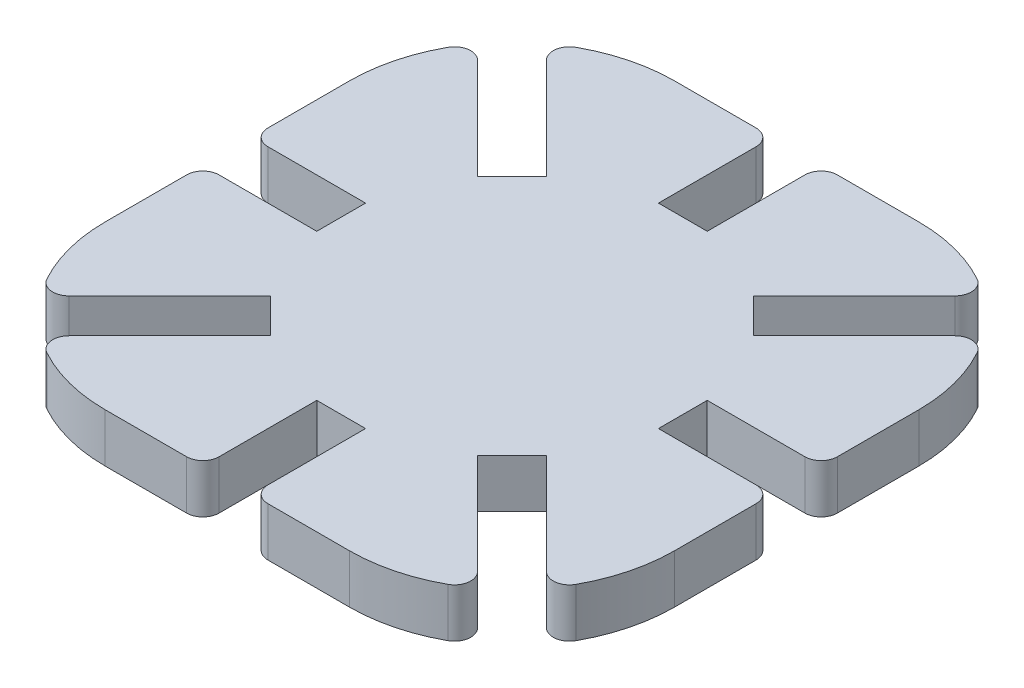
from build123d import *

# Parameters (mm, degrees)
CROQUIS1_W              = 70
CROQUIS1_H              = 70
SALIENTE_EXTRUIR1_DEPTH = 6
REDONDEO1_R             = 20
CROQUIS2_W              = 28
CROQUIS2_H              = 6
CORTAR_EXTRUIR1_DEPTH   = 50.859803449
MATRIZC1_COUNT          = 8
REDONDEO2_R             = 2


with BuildPart() as part:
    # Croquis1 → Saliente-Extruir1 (new body)
    with BuildSketch(Plane(origin=(0, 0, 0), x_dir=(1, 0, 0), z_dir=(0, 1, 0))):
        Rectangle(CROQUIS1_W, CROQUIS1_H)
    extrude(amount=SALIENTE_EXTRUIR1_DEPTH)

    # Redondeo1
    redondeo1_edges = [part.edges().sort_by_distance(p)[0] for p in [
        (35, 3, 35),
        (-35, 3, 35),
        (-35, 3, -35),
        (35, 3, -35),
    ]]
    fillet(redondeo1_edges, radius=REDONDEO1_R)

    # Croquis2 → Cortar-Extruir1 (cut, through all)
    with BuildSketch(Plane(origin=(0, 6, 0), x_dir=(1, 0, 0), z_dir=(0, 1, 0))):
        with Locations((-35, 0)):
            Rectangle(CROQUIS2_W, CROQUIS2_H)
    cortar_extruir1 = extrude(amount=-CORTAR_EXTRUIR1_DEPTH, mode=Mode.SUBTRACT)

    # MatrizC1: Cortar-Extruir1 ×8 about axis
    matrizc1_axis = Axis((0, 0, 0), (0, 1, 0))
    for i in range(1, MATRIZC1_COUNT):
        add(cortar_extruir1.rotate(matrizc1_axis, i * 360 / MATRIZC1_COUNT), mode=Mode.SUBTRACT)

    # Redondeo2
    redondeo2_edges = [part.edges().sort_by_distance(p)[0] for p in [
        (35, 3, -3),
        (35, 3, 3),
        (3, 3, 35),
        (-3, 3, 35),
        (-35, 3, 3),
        (-35, 3, -3),
        (-31.103451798, 3, 26.860811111),
        (-26.860811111, 3, 31.103451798),
        (26.860811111, 3, 31.103451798),
        (31.103451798, 3, 26.860811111),
        (31.103451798, 3, -26.860811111),
        (26.860811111, 3, -31.103451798),
        (-26.860811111, 3, -31.103451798),
        (-31.103451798, 3, -26.860811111),
        (-3, 3, -35),
        (3, 3, -35),
    ]]
    fillet(redondeo2_edges, radius=REDONDEO2_R)


solid = part.part
